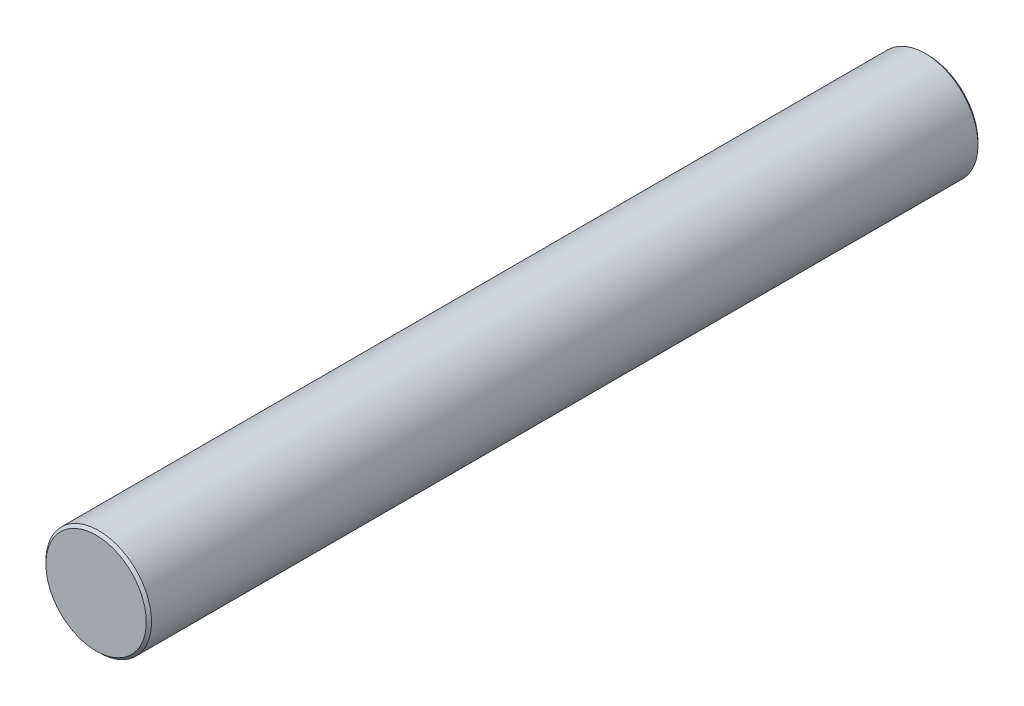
ISO-10303-21;
HEADER;
FILE_DESCRIPTION(('STEP AP214'),'2;1');
FILE_NAME('part.step','',(''),(''),'','','');
FILE_SCHEMA(('AUTOMOTIVE_DESIGN { 1 0 10303 214 1 1 1 1 }'));
ENDSEC;
DATA;
#1=APPLICATION_CONTEXT('core data for automotive mechanical design processes');
#2=APPLICATION_PROTOCOL_DEFINITION('international standard','automotive_design',2000,#1);
#3=PRODUCT_CONTEXT('',#1,'mechanical');
#4=PRODUCT('Part','Part','',(#3));
#5=PRODUCT_RELATED_PRODUCT_CATEGORY('part','',(#4));
#6=PRODUCT_DEFINITION_FORMATION('','',#4);
#7=PRODUCT_DEFINITION_CONTEXT('part definition',#1,'design');
#8=PRODUCT_DEFINITION('design','',#6,#7);
#9=PRODUCT_DEFINITION_SHAPE('','',#8);
#10=(LENGTH_UNIT() NAMED_UNIT(*) SI_UNIT(.MILLI.,.METRE.));
#11=(NAMED_UNIT(*) PLANE_ANGLE_UNIT() SI_UNIT($,.RADIAN.));
#12=(NAMED_UNIT(*) SI_UNIT($,.STERADIAN.) SOLID_ANGLE_UNIT());
#13=UNCERTAINTY_MEASURE_WITH_UNIT(LENGTH_MEASURE(1.E-05),#10,'distance_accuracy_value','');
#14=(GEOMETRIC_REPRESENTATION_CONTEXT(3) GLOBAL_UNCERTAINTY_ASSIGNED_CONTEXT((#13)) GLOBAL_UNIT_ASSIGNED_CONTEXT((#10,
#11,#12)) REPRESENTATION_CONTEXT('',''));
#15=CARTESIAN_POINT('',(0.,0.,0.));
#16=DIRECTION('',(0.,0.,1.));
#17=DIRECTION('',(1.,0.,0.));
#18=AXIS2_PLACEMENT_3D('',#15,#16,#17);
#19=CARTESIAN_POINT('',(0.,0.,630.));
#20=DIRECTION('',(0.,0.,-1.));
#21=DIRECTION('',(-1.,0.,0.));
#22=AXIS2_PLACEMENT_3D('',#19,#20,#21);
#23=CYLINDRICAL_SURFACE('',#22,40.);
#24=CARTESIAN_POINT('',(0.,0.,628.));
#25=DIRECTION('',(0.,0.,1.));
#26=DIRECTION('',(1.,0.,0.));
#27=AXIS2_PLACEMENT_3D('',#24,#25,#26);
#28=CIRCLE('',#27,40.);
#29=CARTESIAN_POINT('',(40.,0.,628.));
#30=VERTEX_POINT('',#29);
#31=EDGE_CURVE('E46',#30,#30,#28,.F.);
#32=ORIENTED_EDGE('',*,*,#31,.T.);
#33=EDGE_LOOP('',(#32));
#34=FACE_BOUND('',#33,.T.);
#35=CARTESIAN_POINT('',(0.,0.,2.));
#36=DIRECTION('',(0.,0.,1.));
#37=DIRECTION('',(1.,0.,0.));
#38=AXIS2_PLACEMENT_3D('',#35,#36,#37);
#39=CIRCLE('',#38,40.);
#40=CARTESIAN_POINT('',(40.,0.,2.));
#41=VERTEX_POINT('',#40);
#42=EDGE_CURVE('E63',#41,#41,#39,.T.);
#43=ORIENTED_EDGE('',*,*,#42,.T.);
#44=EDGE_LOOP('',(#43));
#45=FACE_BOUND('',#44,.T.);
#46=ADVANCED_FACE('F39',(#34,#45),#23,.T.);
#47=CARTESIAN_POINT('',(0.,0.,630.));
#48=DIRECTION('',(0.,0.,1.));
#49=DIRECTION('',(1.,0.,0.));
#50=AXIS2_PLACEMENT_3D('',#47,#48,#49);
#51=PLANE('',#50);
#52=CARTESIAN_POINT('',(0.,0.,630.));
#53=DIRECTION('',(0.,0.,1.));
#54=DIRECTION('',(1.,0.,0.));
#55=AXIS2_PLACEMENT_3D('',#52,#53,#54);
#56=CIRCLE('',#55,38.);
#57=CARTESIAN_POINT('',(38.,0.,630.));
#58=VERTEX_POINT('',#57);
#59=EDGE_CURVE('E59',#58,#58,#56,.T.);
#60=ORIENTED_EDGE('',*,*,#59,.T.);
#61=EDGE_LOOP('',(#60));
#62=FACE_BOUND('',#61,.T.);
#63=ADVANCED_FACE('F79',(#62),#51,.T.);
#64=CARTESIAN_POINT('',(0.,0.,0.));
#65=DIRECTION('',(0.,0.,1.));
#66=DIRECTION('',(1.,0.,0.));
#67=AXIS2_PLACEMENT_3D('',#64,#65,#66);
#68=PLANE('',#67);
#69=CARTESIAN_POINT('',(0.,0.,0.));
#70=DIRECTION('',(0.,0.,1.));
#71=DIRECTION('',(1.,0.,0.));
#72=AXIS2_PLACEMENT_3D('',#69,#70,#71);
#73=CIRCLE('',#72,38.);
#74=CARTESIAN_POINT('',(38.,0.,0.));
#75=VERTEX_POINT('',#74);
#76=EDGE_CURVE('E11',#75,#75,#73,.F.);
#77=ORIENTED_EDGE('',*,*,#76,.T.);
#78=EDGE_LOOP('',(#77));
#79=FACE_BOUND('',#78,.T.);
#80=CARTESIAN_POINT('',(0.,0.,0.));
#81=DIRECTION('',(0.,0.,-1.));
#82=DIRECTION('',(-1.,0.,0.));
#83=AXIS2_PLACEMENT_3D('',#80,#81,#82);
#84=CIRCLE('',#83,6.99999999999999);
#85=CARTESIAN_POINT('',(-6.99999999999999,0.,0.));
#86=VERTEX_POINT('',#85);
#87=EDGE_CURVE('E60',#86,#86,#84,.T.);
#88=ORIENTED_EDGE('',*,*,#87,.F.);
#89=EDGE_LOOP('',(#88));
#90=FACE_BOUND('',#89,.T.);
#91=ADVANCED_FACE('F53',(#79,#90),#68,.F.);
#92=CARTESIAN_POINT('',(0.,0.,38.));
#93=DIRECTION('',(0.,0.,-1.));
#94=DIRECTION('',(-1.,0.,0.));
#95=AXIS2_PLACEMENT_3D('',#92,#93,#94);
#96=CONICAL_SURFACE('',#95,6.99999999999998,1.02974425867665);
#97=CARTESIAN_POINT('',(0.,0.,42.2060243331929));
#98=VERTEX_POINT('',#97);
#99=VERTEX_LOOP('',#98);
#100=FACE_BOUND('',#99,.T.);
#101=CARTESIAN_POINT('',(0.,0.,38.));
#102=DIRECTION('',(0.,0.,-1.));
#103=DIRECTION('',(-1.,0.,0.));
#104=AXIS2_PLACEMENT_3D('',#101,#102,#103);
#105=CIRCLE('',#104,6.99999999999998);
#106=CARTESIAN_POINT('',(-6.99999999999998,0.,38.));
#107=VERTEX_POINT('',#106);
#108=EDGE_CURVE('E57',#107,#107,#105,.T.);
#109=ORIENTED_EDGE('',*,*,#108,.T.);
#110=EDGE_LOOP('',(#109));
#111=FACE_BOUND('',#110,.T.);
#112=ADVANCED_FACE('F49',(#100,#111),#96,.F.);
#113=CARTESIAN_POINT('',(0.,0.,0.));
#114=DIRECTION('',(0.,0.,-1.));
#115=DIRECTION('',(-1.,0.,0.));
#116=AXIS2_PLACEMENT_3D('',#113,#114,#115);
#117=CYLINDRICAL_SURFACE('',#116,6.99999999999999);
#118=ORIENTED_EDGE('',*,*,#108,.F.);
#119=EDGE_LOOP('',(#118));
#120=FACE_BOUND('',#119,.T.);
#121=ORIENTED_EDGE('',*,*,#87,.T.);
#122=EDGE_LOOP('',(#121));
#123=FACE_BOUND('',#122,.T.);
#124=ADVANCED_FACE('F52',(#120,#123),#117,.F.);
#125=CARTESIAN_POINT('',(0.,0.,630.));
#126=DIRECTION('',(0.,0.,-1.));
#127=DIRECTION('',(-1.,0.,0.));
#128=AXIS2_PLACEMENT_3D('',#125,#126,#127);
#129=CONICAL_SURFACE('',#128,38.,0.78539816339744);
#130=ORIENTED_EDGE('',*,*,#31,.F.);
#131=EDGE_LOOP('',(#130));
#132=FACE_BOUND('',#131,.T.);
#133=ORIENTED_EDGE('',*,*,#59,.F.);
#134=EDGE_LOOP('',(#133));
#135=FACE_BOUND('',#134,.T.);
#136=ADVANCED_FACE('F74',(#132,#135),#129,.T.);
#137=CARTESIAN_POINT('',(0.,0.,2.));
#138=DIRECTION('',(0.,0.,1.));
#139=DIRECTION('',(1.,0.,0.));
#140=AXIS2_PLACEMENT_3D('',#137,#138,#139);
#141=CONICAL_SURFACE('',#140,40.,0.78539816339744);
#142=ORIENTED_EDGE('',*,*,#76,.F.);
#143=EDGE_LOOP('',(#142));
#144=FACE_BOUND('',#143,.T.);
#145=ORIENTED_EDGE('',*,*,#42,.F.);
#146=EDGE_LOOP('',(#145));
#147=FACE_BOUND('',#146,.T.);
#148=ADVANCED_FACE('F41',(#144,#147),#141,.T.);
#149=CLOSED_SHELL('',(#46,#63,#91,#112,#124,#136,#148));
#150=MANIFOLD_SOLID_BREP('B2',#149);
#151=ADVANCED_BREP_SHAPE_REPRESENTATION('',(#18,#150),#14);
#152=SHAPE_DEFINITION_REPRESENTATION(#9,#151);
ENDSEC;
END-ISO-10303-21;
